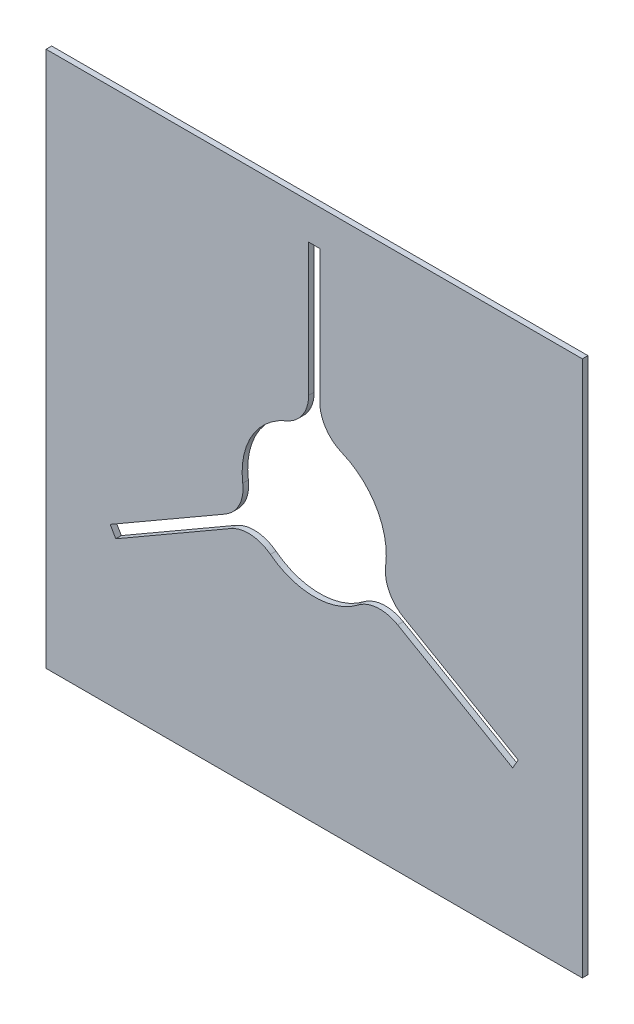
ISO-10303-21;
HEADER;
FILE_DESCRIPTION(('STEP AP214'),'2;1');
FILE_NAME('part.step','',(''),(''),'','','');
FILE_SCHEMA(('AUTOMOTIVE_DESIGN { 1 0 10303 214 1 1 1 1 }'));
ENDSEC;
DATA;
#1=APPLICATION_CONTEXT('core data for automotive mechanical design processes');
#2=APPLICATION_PROTOCOL_DEFINITION('international standard','automotive_design',2000,#1);
#3=PRODUCT_CONTEXT('',#1,'mechanical');
#4=PRODUCT('Part','Part','',(#3));
#5=PRODUCT_RELATED_PRODUCT_CATEGORY('part','',(#4));
#6=PRODUCT_DEFINITION_FORMATION('','',#4);
#7=PRODUCT_DEFINITION_CONTEXT('part definition',#1,'design');
#8=PRODUCT_DEFINITION('design','',#6,#7);
#9=PRODUCT_DEFINITION_SHAPE('','',#8);
#10=(LENGTH_UNIT() NAMED_UNIT(*) SI_UNIT(.MILLI.,.METRE.));
#11=(NAMED_UNIT(*) PLANE_ANGLE_UNIT() SI_UNIT($,.RADIAN.));
#12=(NAMED_UNIT(*) SI_UNIT($,.STERADIAN.) SOLID_ANGLE_UNIT());
#13=UNCERTAINTY_MEASURE_WITH_UNIT(LENGTH_MEASURE(1.E-05),#10,'distance_accuracy_value','');
#14=(GEOMETRIC_REPRESENTATION_CONTEXT(3) GLOBAL_UNCERTAINTY_ASSIGNED_CONTEXT((#13)) GLOBAL_UNIT_ASSIGNED_CONTEXT((#10,
#11,#12)) REPRESENTATION_CONTEXT('',''));
#15=CARTESIAN_POINT('',(0.,0.,0.));
#16=DIRECTION('',(0.,0.,1.));
#17=DIRECTION('',(1.,0.,0.));
#18=AXIS2_PLACEMENT_3D('',#15,#16,#17);
#19=CARTESIAN_POINT('',(0.,0.,0.));
#20=DIRECTION('',(0.,0.,1.));
#21=DIRECTION('',(1.,0.,0.));
#22=AXIS2_PLACEMENT_3D('',#19,#20,#21);
#23=CYLINDRICAL_SURFACE('',#22,20.4851);
#24=CARTESIAN_POINT('',(0.,0.,1.5875));
#25=DIRECTION('',(0.,0.,1.));
#26=DIRECTION('',(1.,0.,0.));
#27=AXIS2_PLACEMENT_3D('',#24,#25,#26);
#28=CIRCLE('',#27,20.4851);
#29=CARTESIAN_POINT('',(-7.85276315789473,18.9201858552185,1.5875));
#30=VERTEX_POINT('',#29);
#31=CARTESIAN_POINT('',(-20.3117431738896,-2.65940054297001,1.5875));
#32=VERTEX_POINT('',#31);
#33=EDGE_CURVE('E273',#30,#32,#28,.T.);
#34=ORIENTED_EDGE('',*,*,#33,.T.);
#35=DIRECTION('',(0.,0.,1.));
#36=VECTOR('',#35,1.);
#37=CARTESIAN_POINT('',(-20.3117431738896,-2.65940054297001,0.));
#38=LINE('',#37,#36);
#39=CARTESIAN_POINT('',(-20.3117431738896,-2.65940054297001,0.));
#40=VERTEX_POINT('',#39);
#41=EDGE_CURVE('E325',#32,#40,#38,.F.);
#42=ORIENTED_EDGE('',*,*,#41,.T.);
#43=CARTESIAN_POINT('',(0.,0.,0.));
#44=DIRECTION('',(0.,0.,1.));
#45=DIRECTION('',(1.,0.,0.));
#46=AXIS2_PLACEMENT_3D('',#43,#44,#45);
#47=CIRCLE('',#46,20.4851);
#48=CARTESIAN_POINT('',(-7.85276315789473,18.9201858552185,0.));
#49=VERTEX_POINT('',#48);
#50=EDGE_CURVE('E267',#49,#40,#47,.T.);
#51=ORIENTED_EDGE('',*,*,#50,.F.);
#52=DIRECTION('',(0.,0.,1.));
#53=VECTOR('',#52,1.);
#54=CARTESIAN_POINT('',(-7.85276315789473,18.9201858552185,0.));
#55=LINE('',#54,#53);
#56=EDGE_CURVE('E306',#49,#30,#55,.T.);
#57=ORIENTED_EDGE('',*,*,#56,.T.);
#58=EDGE_LOOP('',(#34,#42,#51,#57));
#59=FACE_BOUND('',#58,.T.);
#60=ADVANCED_FACE('F41',(#59),#23,.F.);
#61=CARTESIAN_POINT('',(-12.4589800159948,-16.2607853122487,1.5875));
#62=VERTEX_POINT('',#61);
#63=CARTESIAN_POINT('',(12.458980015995,-16.2607853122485,1.5875));
#64=VERTEX_POINT('',#63);
#65=EDGE_CURVE('E276',#62,#64,#28,.T.);
#66=ORIENTED_EDGE('',*,*,#65,.T.);
#67=DIRECTION('',(0.,0.,1.));
#68=VECTOR('',#67,1.);
#69=CARTESIAN_POINT('',(12.458980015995,-16.2607853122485,0.));
#70=LINE('',#69,#68);
#71=CARTESIAN_POINT('',(12.458980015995,-16.2607853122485,0.));
#72=VERTEX_POINT('',#71);
#73=EDGE_CURVE('E343',#64,#72,#70,.F.);
#74=ORIENTED_EDGE('',*,*,#73,.T.);
#75=CARTESIAN_POINT('',(-12.4589800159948,-16.2607853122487,0.));
#76=VERTEX_POINT('',#75);
#77=EDGE_CURVE('E271',#76,#72,#47,.T.);
#78=ORIENTED_EDGE('',*,*,#77,.F.);
#79=DIRECTION('',(0.,0.,1.));
#80=VECTOR('',#79,1.);
#81=CARTESIAN_POINT('',(-12.4589800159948,-16.2607853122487,0.));
#82=LINE('',#81,#80);
#83=EDGE_CURVE('E338',#76,#62,#82,.T.);
#84=ORIENTED_EDGE('',*,*,#83,.T.);
#85=EDGE_LOOP('',(#66,#74,#78,#84));
#86=FACE_BOUND('',#85,.T.);
#87=ADVANCED_FACE('F366',(#86),#23,.F.);
#88=CARTESIAN_POINT('',(76.2,76.2,1.5875));
#89=DIRECTION('',(-1.,0.,0.));
#90=DIRECTION('',(0.,-1.,0.));
#91=AXIS2_PLACEMENT_3D('',#88,#89,#90);
#92=PLANE('',#91);
#93=DIRECTION('',(0.,1.,0.));
#94=VECTOR('',#93,1.);
#95=CARTESIAN_POINT('',(76.2,76.2,0.));
#96=LINE('',#95,#94);
#97=CARTESIAN_POINT('',(76.2,-76.2,0.));
#98=VERTEX_POINT('',#97);
#99=CARTESIAN_POINT('',(76.2,76.2,0.));
#100=VERTEX_POINT('',#99);
#101=EDGE_CURVE('E270',#98,#100,#96,.T.);
#102=ORIENTED_EDGE('',*,*,#101,.T.);
#103=DIRECTION('',(0.,0.,-1.));
#104=VECTOR('',#103,1.);
#105=CARTESIAN_POINT('',(76.2,76.2,1.5875));
#106=LINE('',#105,#104);
#107=CARTESIAN_POINT('',(76.2,76.2,1.5875));
#108=VERTEX_POINT('',#107);
#109=EDGE_CURVE('E303',#108,#100,#106,.T.);
#110=ORIENTED_EDGE('',*,*,#109,.F.);
#111=DIRECTION('',(0.,1.,0.));
#112=VECTOR('',#111,1.);
#113=CARTESIAN_POINT('',(76.2,76.2,1.5875));
#114=LINE('',#113,#112);
#115=CARTESIAN_POINT('',(76.2,-76.2,1.5875));
#116=VERTEX_POINT('',#115);
#117=EDGE_CURVE('E277',#116,#108,#114,.T.);
#118=ORIENTED_EDGE('',*,*,#117,.F.);
#119=DIRECTION('',(0.,0.,-1.));
#120=VECTOR('',#119,1.);
#121=CARTESIAN_POINT('',(76.2,-76.2,1.5875));
#122=LINE('',#121,#120);
#123=EDGE_CURVE('E287',#116,#98,#122,.T.);
#124=ORIENTED_EDGE('',*,*,#123,.T.);
#125=EDGE_LOOP('',(#102,#110,#118,#124));
#126=FACE_BOUND('',#125,.T.);
#127=ADVANCED_FACE('F433',(#126),#92,.F.);
#128=CARTESIAN_POINT('',(-76.2,76.2,1.5875));
#129=DIRECTION('',(0.,-1.,0.));
#130=DIRECTION('',(0.,0.,-1.));
#131=AXIS2_PLACEMENT_3D('',#128,#129,#130);
#132=PLANE('',#131);
#133=DIRECTION('',(-1.,0.,0.));
#134=VECTOR('',#133,1.);
#135=CARTESIAN_POINT('',(-76.2,76.2,0.));
#136=LINE('',#135,#134);
#137=CARTESIAN_POINT('',(-76.2,76.2,0.));
#138=VERTEX_POINT('',#137);
#139=EDGE_CURVE('E290',#100,#138,#136,.T.);
#140=ORIENTED_EDGE('',*,*,#139,.T.);
#141=DIRECTION('',(0.,0.,-1.));
#142=VECTOR('',#141,1.);
#143=CARTESIAN_POINT('',(-76.2,76.2,1.5875));
#144=LINE('',#143,#142);
#145=CARTESIAN_POINT('',(-76.2,76.2,1.5875));
#146=VERTEX_POINT('',#145);
#147=EDGE_CURVE('E300',#146,#138,#144,.T.);
#148=ORIENTED_EDGE('',*,*,#147,.F.);
#149=DIRECTION('',(-1.,0.,0.));
#150=VECTOR('',#149,1.);
#151=CARTESIAN_POINT('',(-76.2,76.2,1.5875));
#152=LINE('',#151,#150);
#153=EDGE_CURVE('E280',#108,#146,#152,.T.);
#154=ORIENTED_EDGE('',*,*,#153,.F.);
#155=ORIENTED_EDGE('',*,*,#109,.T.);
#156=EDGE_LOOP('',(#140,#148,#154,#155));
#157=FACE_BOUND('',#156,.T.);
#158=ADVANCED_FACE('F454',(#157),#132,.F.);
#159=CARTESIAN_POINT('',(-76.2,76.2,1.5875));
#160=DIRECTION('',(1.,0.,0.));
#161=DIRECTION('',(0.,1.,0.));
#162=AXIS2_PLACEMENT_3D('',#159,#160,#161);
#163=PLANE('',#162);
#164=DIRECTION('',(0.,-1.,0.));
#165=VECTOR('',#164,1.);
#166=CARTESIAN_POINT('',(-76.2,76.2,0.));
#167=LINE('',#166,#165);
#168=CARTESIAN_POINT('',(-76.2,-76.2,0.));
#169=VERTEX_POINT('',#168);
#170=EDGE_CURVE('E292',#138,#169,#167,.T.);
#171=ORIENTED_EDGE('',*,*,#170,.T.);
#172=DIRECTION('',(0.,0.,-1.));
#173=VECTOR('',#172,1.);
#174=CARTESIAN_POINT('',(-76.2,-76.2,1.5875));
#175=LINE('',#174,#173);
#176=CARTESIAN_POINT('',(-76.2,-76.2,1.5875));
#177=VERTEX_POINT('',#176);
#178=EDGE_CURVE('E297',#177,#169,#175,.T.);
#179=ORIENTED_EDGE('',*,*,#178,.F.);
#180=DIRECTION('',(0.,-1.,0.));
#181=VECTOR('',#180,1.);
#182=CARTESIAN_POINT('',(-76.2,76.2,1.5875));
#183=LINE('',#182,#181);
#184=EDGE_CURVE('E283',#146,#177,#183,.T.);
#185=ORIENTED_EDGE('',*,*,#184,.F.);
#186=ORIENTED_EDGE('',*,*,#147,.T.);
#187=EDGE_LOOP('',(#171,#179,#185,#186));
#188=FACE_BOUND('',#187,.T.);
#189=ADVANCED_FACE('F450',(#188),#163,.F.);
#190=CARTESIAN_POINT('',(-76.2,-76.2,1.5875));
#191=DIRECTION('',(0.,1.,0.));
#192=DIRECTION('',(0.,0.,1.));
#193=AXIS2_PLACEMENT_3D('',#190,#191,#192);
#194=PLANE('',#193);
#195=DIRECTION('',(1.,0.,0.));
#196=VECTOR('',#195,1.);
#197=CARTESIAN_POINT('',(-76.2,-76.2,0.));
#198=LINE('',#197,#196);
#199=EDGE_CURVE('E281',#169,#98,#198,.T.);
#200=ORIENTED_EDGE('',*,*,#199,.T.);
#201=ORIENTED_EDGE('',*,*,#123,.F.);
#202=DIRECTION('',(1.,0.,0.));
#203=VECTOR('',#202,1.);
#204=CARTESIAN_POINT('',(-76.2,-76.2,1.5875));
#205=LINE('',#204,#203);
#206=EDGE_CURVE('E285',#177,#116,#205,.T.);
#207=ORIENTED_EDGE('',*,*,#206,.F.);
#208=ORIENTED_EDGE('',*,*,#178,.T.);
#209=EDGE_LOOP('',(#200,#201,#207,#208));
#210=FACE_BOUND('',#209,.T.);
#211=ADVANCED_FACE('F446',(#210),#194,.F.);
#212=CARTESIAN_POINT('',(0.,0.,1.5875));
#213=DIRECTION('',(0.,0.,1.));
#214=DIRECTION('',(1.,0.,0.));
#215=AXIS2_PLACEMENT_3D('',#212,#213,#214);
#216=PLANE('',#215);
#217=DIRECTION('',(0.866025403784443,-0.499999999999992,0.));
#218=VECTOR('',#217,1.);
#219=CARTESIAN_POINT('',(56.3985676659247,-34.3948153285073,1.5875));
#220=LINE('',#219,#218);
#221=CARTESIAN_POINT('',(23.7182633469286,-15.5268328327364,1.5875));
#222=VERTEX_POINT('',#221);
#223=CARTESIAN_POINT('',(56.3985676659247,-34.3948153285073,1.5875));
#224=VERTEX_POINT('',#223);
#225=EDGE_CURVE('E207',#222,#224,#220,.T.);
#226=ORIENTED_EDGE('',*,*,#225,.F.);
#227=CARTESIAN_POINT('',(18.6382633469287,-24.3256509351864,1.5875));
#228=DIRECTION('',(0.,0.,1.));
#229=DIRECTION('',(1.,0.,0.));
#230=AXIS2_PLACEMENT_3D('',#227,#228,#229);
#231=CIRCLE('',#230,10.16);
#232=EDGE_CURVE('E352',#222,#64,#231,.T.);
#233=ORIENTED_EDGE('',*,*,#232,.T.);
#234=ORIENTED_EDGE('',*,*,#65,.F.);
#235=CARTESIAN_POINT('',(-18.6382633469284,-24.3256509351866,1.5875));
#236=DIRECTION('',(0.,0.,1.));
#237=DIRECTION('',(1.,0.,0.));
#238=AXIS2_PLACEMENT_3D('',#235,#236,#237);
#239=CIRCLE('',#238,10.16);
#240=CARTESIAN_POINT('',(-23.7182633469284,-15.5268328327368,1.5875));
#241=VERTEX_POINT('',#240);
#242=EDGE_CURVE('E334',#62,#241,#239,.T.);
#243=ORIENTED_EDGE('',*,*,#242,.T.);
#244=DIRECTION('',(0.866025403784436,0.500000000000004,0.));
#245=VECTOR('',#244,1.);
#246=CARTESIAN_POINT('',(-56.3985676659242,-34.3948153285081,1.5875));
#247=LINE('',#246,#245);
#248=CARTESIAN_POINT('',(-56.3985676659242,-34.3948153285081,1.5875));
#249=VERTEX_POINT('',#248);
#250=EDGE_CURVE('E228',#249,#241,#247,.T.);
#251=ORIENTED_EDGE('',*,*,#250,.F.);
#252=DIRECTION('',(0.500000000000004,-0.866025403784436,0.));
#253=VECTOR('',#252,1.);
#254=CARTESIAN_POINT('',(-56.3985676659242,-34.3948153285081,1.5875));
#255=LINE('',#254,#253);
#256=CARTESIAN_POINT('',(-57.9860676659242,-31.6451846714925,1.5875));
#257=VERTEX_POINT('',#256);
#258=EDGE_CURVE('E236',#257,#249,#255,.T.);
#259=ORIENTED_EDGE('',*,*,#258,.F.);
#260=DIRECTION('',(-0.866025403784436,-0.500000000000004,0.));
#261=VECTOR('',#260,1.);
#262=CARTESIAN_POINT('',(-57.9860676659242,-31.6451846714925,1.5875));
#263=LINE('',#262,#261);
#264=CARTESIAN_POINT('',(-25.3057633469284,-12.7772021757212,1.5875));
#265=VERTEX_POINT('',#264);
#266=EDGE_CURVE('E223',#265,#257,#263,.T.);
#267=ORIENTED_EDGE('',*,*,#266,.F.);
#268=CARTESIAN_POINT('',(-30.3857633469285,-3.97838407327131,1.5875));
#269=DIRECTION('',(0.,0.,1.));
#270=DIRECTION('',(1.,0.,0.));
#271=AXIS2_PLACEMENT_3D('',#268,#269,#270);
#272=CIRCLE('',#271,10.16);
#273=EDGE_CURVE('E336',#265,#32,#272,.T.);
#274=ORIENTED_EDGE('',*,*,#273,.T.);
#275=ORIENTED_EDGE('',*,*,#33,.F.);
#276=CARTESIAN_POINT('',(-11.7475,28.3040350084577,1.5875));
#277=DIRECTION('',(0.,0.,1.));
#278=DIRECTION('',(1.,0.,0.));
#279=AXIS2_PLACEMENT_3D('',#276,#277,#278);
#280=CIRCLE('',#279,10.16);
#281=CARTESIAN_POINT('',(-1.5875,28.3040350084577,1.5875));
#282=VERTEX_POINT('',#281);
#283=EDGE_CURVE('E318',#30,#282,#280,.T.);
#284=ORIENTED_EDGE('',*,*,#283,.T.);
#285=DIRECTION('',(0.,-1.,0.));
#286=VECTOR('',#285,1.);
#287=CARTESIAN_POINT('',(-1.5875,66.04,1.5875));
#288=LINE('',#287,#286);
#289=CARTESIAN_POINT('',(-1.5875,66.04,1.5875));
#290=VERTEX_POINT('',#289);
#291=EDGE_CURVE('E249',#290,#282,#288,.T.);
#292=ORIENTED_EDGE('',*,*,#291,.F.);
#293=DIRECTION('',(-1.,0.,0.));
#294=VECTOR('',#293,1.);
#295=CARTESIAN_POINT('',(-1.5875,66.04,1.5875));
#296=LINE('',#295,#294);
#297=CARTESIAN_POINT('',(1.5875,66.04,1.5875));
#298=VERTEX_POINT('',#297);
#299=EDGE_CURVE('E257',#298,#290,#296,.T.);
#300=ORIENTED_EDGE('',*,*,#299,.F.);
#301=DIRECTION('',(0.,1.,0.));
#302=VECTOR('',#301,1.);
#303=CARTESIAN_POINT('',(1.5875,66.04,1.5875));
#304=LINE('',#303,#302);
#305=CARTESIAN_POINT('',(1.5875,28.3040350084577,1.5875));
#306=VERTEX_POINT('',#305);
#307=EDGE_CURVE('E243',#306,#298,#304,.T.);
#308=ORIENTED_EDGE('',*,*,#307,.F.);
#309=CARTESIAN_POINT('',(11.7475,28.3040350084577,1.5875));
#310=DIRECTION('',(0.,0.,1.));
#311=DIRECTION('',(1.,0.,0.));
#312=AXIS2_PLACEMENT_3D('',#309,#310,#311);
#313=CIRCLE('',#312,10.16);
#314=CARTESIAN_POINT('',(7.85276315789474,18.9201858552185,1.5875));
#315=VERTEX_POINT('',#314);
#316=EDGE_CURVE('E320',#306,#315,#313,.T.);
#317=ORIENTED_EDGE('',*,*,#316,.T.);
#318=CARTESIAN_POINT('',(20.3117431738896,-2.65940054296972,1.5875));
#319=VERTEX_POINT('',#318);
#320=EDGE_CURVE('E264',#319,#315,#28,.T.);
#321=ORIENTED_EDGE('',*,*,#320,.F.);
#322=CARTESIAN_POINT('',(30.3857633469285,-3.97838407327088,1.5875));
#323=DIRECTION('',(0.,0.,1.));
#324=DIRECTION('',(1.,0.,0.));
#325=AXIS2_PLACEMENT_3D('',#322,#323,#324);
#326=CIRCLE('',#325,10.16);
#327=CARTESIAN_POINT('',(25.3057633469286,-12.7772021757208,1.5875));
#328=VERTEX_POINT('',#327);
#329=EDGE_CURVE('E56',#319,#328,#326,.T.);
#330=ORIENTED_EDGE('',*,*,#329,.T.);
#331=DIRECTION('',(-0.866025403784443,0.499999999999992,0.));
#332=VECTOR('',#331,1.);
#333=CARTESIAN_POINT('',(57.9860676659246,-31.6451846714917,1.5875));
#334=LINE('',#333,#332);
#335=CARTESIAN_POINT('',(57.9860676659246,-31.6451846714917,1.5875));
#336=VERTEX_POINT('',#335);
#337=EDGE_CURVE('E201',#336,#328,#334,.T.);
#338=ORIENTED_EDGE('',*,*,#337,.F.);
#339=DIRECTION('',(0.499999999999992,0.866025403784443,0.));
#340=VECTOR('',#339,1.);
#341=CARTESIAN_POINT('',(57.9860676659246,-31.6451846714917,1.5875));
#342=LINE('',#341,#340);
#343=EDGE_CURVE('E220',#224,#336,#342,.T.);
#344=ORIENTED_EDGE('',*,*,#343,.F.);
#345=EDGE_LOOP('',(#226,#233,#234,#243,#251,#259,#267,#274,#275,#284,#292,#300,#308,#317,#321,
#330,#338,#344));
#346=FACE_BOUND('',#345,.T.);
#347=ORIENTED_EDGE('',*,*,#117,.T.);
#348=ORIENTED_EDGE('',*,*,#153,.T.);
#349=ORIENTED_EDGE('',*,*,#184,.T.);
#350=ORIENTED_EDGE('',*,*,#206,.T.);
#351=EDGE_LOOP('',(#347,#348,#349,#350));
#352=FACE_BOUND('',#351,.T.);
#353=ADVANCED_FACE('F357',(#346,#352),#216,.T.);
#354=CARTESIAN_POINT('',(0.,0.,0.));
#355=DIRECTION('',(0.,0.,1.));
#356=DIRECTION('',(1.,0.,0.));
#357=AXIS2_PLACEMENT_3D('',#354,#355,#356);
#358=PLANE('',#357);
#359=ORIENTED_EDGE('',*,*,#77,.T.);
#360=CARTESIAN_POINT('',(18.6382633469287,-24.3256509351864,0.));
#361=DIRECTION('',(0.,0.,1.));
#362=DIRECTION('',(1.,0.,0.));
#363=AXIS2_PLACEMENT_3D('',#360,#361,#362);
#364=CIRCLE('',#363,10.16);
#365=CARTESIAN_POINT('',(23.7182633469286,-15.5268328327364,0.));
#366=VERTEX_POINT('',#365);
#367=EDGE_CURVE('E198',#72,#366,#364,.F.);
#368=ORIENTED_EDGE('',*,*,#367,.T.);
#369=DIRECTION('',(0.866025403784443,-0.499999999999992,0.));
#370=VECTOR('',#369,1.);
#371=CARTESIAN_POINT('',(56.3985676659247,-34.3948153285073,0.));
#372=LINE('',#371,#370);
#373=CARTESIAN_POINT('',(56.3985676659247,-34.3948153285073,0.));
#374=VERTEX_POINT('',#373);
#375=EDGE_CURVE('E190',#366,#374,#372,.T.);
#376=ORIENTED_EDGE('',*,*,#375,.T.);
#377=DIRECTION('',(0.499999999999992,0.866025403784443,0.));
#378=VECTOR('',#377,1.);
#379=CARTESIAN_POINT('',(57.9860676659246,-31.6451846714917,0.));
#380=LINE('',#379,#378);
#381=CARTESIAN_POINT('',(57.9860676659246,-31.6451846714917,0.));
#382=VERTEX_POINT('',#381);
#383=EDGE_CURVE('E197',#374,#382,#380,.T.);
#384=ORIENTED_EDGE('',*,*,#383,.T.);
#385=DIRECTION('',(-0.866025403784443,0.499999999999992,0.));
#386=VECTOR('',#385,1.);
#387=CARTESIAN_POINT('',(57.9860676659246,-31.6451846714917,0.));
#388=LINE('',#387,#386);
#389=CARTESIAN_POINT('',(25.3057633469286,-12.7772021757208,0.));
#390=VERTEX_POINT('',#389);
#391=EDGE_CURVE('E212',#382,#390,#388,.T.);
#392=ORIENTED_EDGE('',*,*,#391,.T.);
#393=CARTESIAN_POINT('',(30.3857633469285,-3.97838407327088,0.));
#394=DIRECTION('',(0.,0.,1.));
#395=DIRECTION('',(1.,0.,0.));
#396=AXIS2_PLACEMENT_3D('',#393,#394,#395);
#397=CIRCLE('',#396,10.16);
#398=CARTESIAN_POINT('',(20.3117431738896,-2.65940054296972,0.));
#399=VERTEX_POINT('',#398);
#400=EDGE_CURVE('E346',#390,#399,#397,.F.);
#401=ORIENTED_EDGE('',*,*,#400,.T.);
#402=CARTESIAN_POINT('',(7.85276315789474,18.9201858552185,0.));
#403=VERTEX_POINT('',#402);
#404=EDGE_CURVE('E272',#399,#403,#47,.T.);
#405=ORIENTED_EDGE('',*,*,#404,.T.);
#406=CARTESIAN_POINT('',(11.7475,28.3040350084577,0.));
#407=DIRECTION('',(0.,0.,1.));
#408=DIRECTION('',(1.,0.,0.));
#409=AXIS2_PLACEMENT_3D('',#406,#407,#408);
#410=CIRCLE('',#409,10.16);
#411=CARTESIAN_POINT('',(1.5875,28.3040350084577,0.));
#412=VERTEX_POINT('',#411);
#413=EDGE_CURVE('E314',#403,#412,#410,.F.);
#414=ORIENTED_EDGE('',*,*,#413,.T.);
#415=DIRECTION('',(0.,1.,0.));
#416=VECTOR('',#415,1.);
#417=CARTESIAN_POINT('',(1.5875,66.04,0.));
#418=LINE('',#417,#416);
#419=CARTESIAN_POINT('',(1.5875,66.04,0.));
#420=VERTEX_POINT('',#419);
#421=EDGE_CURVE('E246',#412,#420,#418,.T.);
#422=ORIENTED_EDGE('',*,*,#421,.T.);
#423=DIRECTION('',(-1.,0.,0.));
#424=VECTOR('',#423,1.);
#425=CARTESIAN_POINT('',(-1.5875,66.04,0.));
#426=LINE('',#425,#424);
#427=CARTESIAN_POINT('',(-1.5875,66.04,0.));
#428=VERTEX_POINT('',#427);
#429=EDGE_CURVE('E248',#420,#428,#426,.T.);
#430=ORIENTED_EDGE('',*,*,#429,.T.);
#431=DIRECTION('',(0.,-1.,0.));
#432=VECTOR('',#431,1.);
#433=CARTESIAN_POINT('',(-1.5875,66.04,0.));
#434=LINE('',#433,#432);
#435=CARTESIAN_POINT('',(-1.5875,28.3040350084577,0.));
#436=VERTEX_POINT('',#435);
#437=EDGE_CURVE('E252',#428,#436,#434,.T.);
#438=ORIENTED_EDGE('',*,*,#437,.T.);
#439=CARTESIAN_POINT('',(-11.7475,28.3040350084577,0.));
#440=DIRECTION('',(0.,0.,1.));
#441=DIRECTION('',(1.,0.,0.));
#442=AXIS2_PLACEMENT_3D('',#439,#440,#441);
#443=CIRCLE('',#442,10.16);
#444=EDGE_CURVE('E312',#436,#49,#443,.F.);
#445=ORIENTED_EDGE('',*,*,#444,.T.);
#446=ORIENTED_EDGE('',*,*,#50,.T.);
#447=CARTESIAN_POINT('',(-30.3857633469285,-3.97838407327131,0.));
#448=DIRECTION('',(0.,0.,1.));
#449=DIRECTION('',(1.,0.,0.));
#450=AXIS2_PLACEMENT_3D('',#447,#448,#449);
#451=CIRCLE('',#450,10.16);
#452=CARTESIAN_POINT('',(-25.3057633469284,-12.7772021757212,0.));
#453=VERTEX_POINT('',#452);
#454=EDGE_CURVE('E330',#40,#453,#451,.F.);
#455=ORIENTED_EDGE('',*,*,#454,.T.);
#456=DIRECTION('',(-0.866025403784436,-0.500000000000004,0.));
#457=VECTOR('',#456,1.);
#458=CARTESIAN_POINT('',(-57.9860676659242,-31.6451846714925,0.));
#459=LINE('',#458,#457);
#460=CARTESIAN_POINT('',(-57.9860676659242,-31.6451846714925,0.));
#461=VERTEX_POINT('',#460);
#462=EDGE_CURVE('E225',#453,#461,#459,.T.);
#463=ORIENTED_EDGE('',*,*,#462,.T.);
#464=DIRECTION('',(0.500000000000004,-0.866025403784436,0.));
#465=VECTOR('',#464,1.);
#466=CARTESIAN_POINT('',(-56.3985676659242,-34.3948153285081,0.));
#467=LINE('',#466,#465);
#468=CARTESIAN_POINT('',(-56.3985676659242,-34.3948153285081,0.));
#469=VERTEX_POINT('',#468);
#470=EDGE_CURVE('E227',#461,#469,#467,.T.);
#471=ORIENTED_EDGE('',*,*,#470,.T.);
#472=DIRECTION('',(0.866025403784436,0.500000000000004,0.));
#473=VECTOR('',#472,1.);
#474=CARTESIAN_POINT('',(-56.3985676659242,-34.3948153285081,0.));
#475=LINE('',#474,#473);
#476=CARTESIAN_POINT('',(-23.7182633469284,-15.5268328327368,0.));
#477=VERTEX_POINT('',#476);
#478=EDGE_CURVE('E231',#469,#477,#475,.T.);
#479=ORIENTED_EDGE('',*,*,#478,.T.);
#480=CARTESIAN_POINT('',(-18.6382633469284,-24.3256509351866,0.));
#481=DIRECTION('',(0.,0.,1.));
#482=DIRECTION('',(1.,0.,0.));
#483=AXIS2_PLACEMENT_3D('',#480,#481,#482);
#484=CIRCLE('',#483,10.16);
#485=EDGE_CURVE('E328',#477,#76,#484,.F.);
#486=ORIENTED_EDGE('',*,*,#485,.T.);
#487=EDGE_LOOP('',(#359,#368,#376,#384,#392,#401,#405,#414,#422,#430,#438,#445,#446,#455,#463,
#471,#479,#486));
#488=FACE_BOUND('',#487,.T.);
#489=ORIENTED_EDGE('',*,*,#101,.F.);
#490=ORIENTED_EDGE('',*,*,#199,.F.);
#491=ORIENTED_EDGE('',*,*,#170,.F.);
#492=ORIENTED_EDGE('',*,*,#139,.F.);
#493=EDGE_LOOP('',(#489,#490,#491,#492));
#494=FACE_BOUND('',#493,.T.);
#495=ADVANCED_FACE('F193',(#488,#494),#358,.F.);
#496=ORIENTED_EDGE('',*,*,#404,.F.);
#497=DIRECTION('',(0.,0.,1.));
#498=VECTOR('',#497,1.);
#499=CARTESIAN_POINT('',(20.3117431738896,-2.65940054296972,0.));
#500=LINE('',#499,#498);
#501=EDGE_CURVE('E49',#399,#319,#500,.T.);
#502=ORIENTED_EDGE('',*,*,#501,.T.);
#503=ORIENTED_EDGE('',*,*,#320,.T.);
#504=DIRECTION('',(0.,0.,1.));
#505=VECTOR('',#504,1.);
#506=CARTESIAN_POINT('',(7.85276315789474,18.9201858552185,0.));
#507=LINE('',#506,#505);
#508=EDGE_CURVE('E309',#315,#403,#507,.F.);
#509=ORIENTED_EDGE('',*,*,#508,.T.);
#510=EDGE_LOOP('',(#496,#502,#503,#509));
#511=FACE_BOUND('',#510,.T.);
#512=ADVANCED_FACE('F355',(#511),#23,.F.);
#513=CARTESIAN_POINT('',(1.5875,66.04,0.));
#514=DIRECTION('',(1.,0.,0.));
#515=DIRECTION('',(0.,1.,0.));
#516=AXIS2_PLACEMENT_3D('',#513,#514,#515);
#517=PLANE('',#516);
#518=ORIENTED_EDGE('',*,*,#421,.F.);
#519=DIRECTION('',(0.,0.,1.));
#520=VECTOR('',#519,1.);
#521=CARTESIAN_POINT('',(1.5875,28.3040350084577,0.));
#522=LINE('',#521,#520);
#523=EDGE_CURVE('E316',#412,#306,#522,.T.);
#524=ORIENTED_EDGE('',*,*,#523,.T.);
#525=ORIENTED_EDGE('',*,*,#307,.T.);
#526=DIRECTION('',(0.,0.,1.));
#527=VECTOR('',#526,1.);
#528=CARTESIAN_POINT('',(1.5875,66.04,0.));
#529=LINE('',#528,#527);
#530=EDGE_CURVE('E255',#420,#298,#529,.T.);
#531=ORIENTED_EDGE('',*,*,#530,.F.);
#532=EDGE_LOOP('',(#518,#524,#525,#531));
#533=FACE_BOUND('',#532,.T.);
#534=ADVANCED_FACE('F380',(#533),#517,.F.);
#535=CARTESIAN_POINT('',(-1.5875,66.04,0.));
#536=DIRECTION('',(-1.,0.,0.));
#537=DIRECTION('',(0.,-1.,0.));
#538=AXIS2_PLACEMENT_3D('',#535,#536,#537);
#539=PLANE('',#538);
#540=ORIENTED_EDGE('',*,*,#291,.T.);
#541=DIRECTION('',(0.,0.,1.));
#542=VECTOR('',#541,1.);
#543=CARTESIAN_POINT('',(-1.5875,28.3040350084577,0.));
#544=LINE('',#543,#542);
#545=EDGE_CURVE('E323',#282,#436,#544,.F.);
#546=ORIENTED_EDGE('',*,*,#545,.T.);
#547=ORIENTED_EDGE('',*,*,#437,.F.);
#548=DIRECTION('',(0.,0.,1.));
#549=VECTOR('',#548,1.);
#550=CARTESIAN_POINT('',(-1.5875,66.04,0.));
#551=LINE('',#550,#549);
#552=EDGE_CURVE('E262',#428,#290,#551,.T.);
#553=ORIENTED_EDGE('',*,*,#552,.T.);
#554=EDGE_LOOP('',(#540,#546,#547,#553));
#555=FACE_BOUND('',#554,.T.);
#556=ADVANCED_FACE('F441',(#555),#539,.F.);
#557=CARTESIAN_POINT('',(-1.5875,66.04,0.));
#558=DIRECTION('',(0.,1.,0.));
#559=DIRECTION('',(0.,0.,1.));
#560=AXIS2_PLACEMENT_3D('',#557,#558,#559);
#561=PLANE('',#560);
#562=ORIENTED_EDGE('',*,*,#299,.T.);
#563=ORIENTED_EDGE('',*,*,#552,.F.);
#564=ORIENTED_EDGE('',*,*,#429,.F.);
#565=ORIENTED_EDGE('',*,*,#530,.T.);
#566=EDGE_LOOP('',(#562,#563,#564,#565));
#567=FACE_BOUND('',#566,.T.);
#568=ADVANCED_FACE('F385',(#567),#561,.F.);
#569=CARTESIAN_POINT('',(11.7475,28.3040350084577,0.));
#570=DIRECTION('',(0.,0.,1.));
#571=DIRECTION('',(1.,0.,0.));
#572=AXIS2_PLACEMENT_3D('',#569,#570,#571);
#573=CYLINDRICAL_SURFACE('',#572,10.16);
#574=ORIENTED_EDGE('',*,*,#316,.F.);
#575=ORIENTED_EDGE('',*,*,#523,.F.);
#576=ORIENTED_EDGE('',*,*,#413,.F.);
#577=ORIENTED_EDGE('',*,*,#508,.F.);
#578=EDGE_LOOP('',(#574,#575,#576,#577));
#579=FACE_BOUND('',#578,.T.);
#580=ADVANCED_FACE('F378',(#579),#573,.T.);
#581=CARTESIAN_POINT('',(-11.7475,28.3040350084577,0.));
#582=DIRECTION('',(0.,0.,1.));
#583=DIRECTION('',(1.,0.,0.));
#584=AXIS2_PLACEMENT_3D('',#581,#582,#583);
#585=CYLINDRICAL_SURFACE('',#584,10.16);
#586=ORIENTED_EDGE('',*,*,#444,.F.);
#587=ORIENTED_EDGE('',*,*,#545,.F.);
#588=ORIENTED_EDGE('',*,*,#283,.F.);
#589=ORIENTED_EDGE('',*,*,#56,.F.);
#590=EDGE_LOOP('',(#586,#587,#588,#589));
#591=FACE_BOUND('',#590,.T.);
#592=ADVANCED_FACE('F394',(#591),#585,.T.);
#593=CARTESIAN_POINT('',(57.9860676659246,-31.6451846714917,0.));
#594=DIRECTION('',(0.499999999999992,0.866025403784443,0.));
#595=DIRECTION('',(-0.866025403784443,0.499999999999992,0.));
#596=AXIS2_PLACEMENT_3D('',#593,#594,#595);
#597=PLANE('',#596);
#598=ORIENTED_EDGE('',*,*,#337,.T.);
#599=DIRECTION('',(0.,0.,1.));
#600=VECTOR('',#599,1.);
#601=CARTESIAN_POINT('',(25.3057633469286,-12.7772021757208,0.));
#602=LINE('',#601,#600);
#603=EDGE_CURVE('E11',#328,#390,#602,.F.);
#604=ORIENTED_EDGE('',*,*,#603,.T.);
#605=ORIENTED_EDGE('',*,*,#391,.F.);
#606=DIRECTION('',(0.,0.,1.));
#607=VECTOR('',#606,1.);
#608=CARTESIAN_POINT('',(57.9860676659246,-31.6451846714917,0.));
#609=LINE('',#608,#607);
#610=EDGE_CURVE('E211',#382,#336,#609,.T.);
#611=ORIENTED_EDGE('',*,*,#610,.T.);
#612=EDGE_LOOP('',(#598,#604,#605,#611));
#613=FACE_BOUND('',#612,.T.);
#614=ADVANCED_FACE('F373',(#613),#597,.F.);
#615=CARTESIAN_POINT('',(56.3985676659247,-34.3948153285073,0.));
#616=DIRECTION('',(-0.499999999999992,-0.866025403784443,0.));
#617=DIRECTION('',(0.866025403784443,-0.499999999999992,0.));
#618=AXIS2_PLACEMENT_3D('',#615,#616,#617);
#619=PLANE('',#618);
#620=ORIENTED_EDGE('',*,*,#375,.F.);
#621=DIRECTION('',(0.,0.,1.));
#622=VECTOR('',#621,1.);
#623=CARTESIAN_POINT('',(23.7182633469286,-15.5268328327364,0.));
#624=LINE('',#623,#622);
#625=EDGE_CURVE('E349',#366,#222,#624,.T.);
#626=ORIENTED_EDGE('',*,*,#625,.T.);
#627=ORIENTED_EDGE('',*,*,#225,.T.);
#628=DIRECTION('',(0.,0.,1.));
#629=VECTOR('',#628,1.);
#630=CARTESIAN_POINT('',(56.3985676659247,-34.3948153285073,0.));
#631=LINE('',#630,#629);
#632=EDGE_CURVE('E204',#374,#224,#631,.T.);
#633=ORIENTED_EDGE('',*,*,#632,.F.);
#634=EDGE_LOOP('',(#620,#626,#627,#633));
#635=FACE_BOUND('',#634,.T.);
#636=ADVANCED_FACE('F205',(#635),#619,.F.);
#637=CARTESIAN_POINT('',(57.9860676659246,-31.6451846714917,0.));
#638=DIRECTION('',(0.866025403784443,-0.499999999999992,0.));
#639=DIRECTION('',(0.499999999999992,0.866025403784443,0.));
#640=AXIS2_PLACEMENT_3D('',#637,#638,#639);
#641=PLANE('',#640);
#642=ORIENTED_EDGE('',*,*,#343,.T.);
#643=ORIENTED_EDGE('',*,*,#610,.F.);
#644=ORIENTED_EDGE('',*,*,#383,.F.);
#645=ORIENTED_EDGE('',*,*,#632,.T.);
#646=EDGE_LOOP('',(#642,#643,#644,#645));
#647=FACE_BOUND('',#646,.T.);
#648=ADVANCED_FACE('F214',(#647),#641,.F.);
#649=CARTESIAN_POINT('',(-57.9860676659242,-31.6451846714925,0.));
#650=DIRECTION('',(-0.500000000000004,0.866025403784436,0.));
#651=DIRECTION('',(-0.866025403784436,-0.500000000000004,0.));
#652=AXIS2_PLACEMENT_3D('',#649,#650,#651);
#653=PLANE('',#652);
#654=ORIENTED_EDGE('',*,*,#462,.F.);
#655=DIRECTION('',(0.,0.,1.));
#656=VECTOR('',#655,1.);
#657=CARTESIAN_POINT('',(-25.3057633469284,-12.7772021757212,0.));
#658=LINE('',#657,#656);
#659=EDGE_CURVE('E332',#453,#265,#658,.T.);
#660=ORIENTED_EDGE('',*,*,#659,.T.);
#661=ORIENTED_EDGE('',*,*,#266,.T.);
#662=DIRECTION('',(0.,0.,1.));
#663=VECTOR('',#662,1.);
#664=CARTESIAN_POINT('',(-57.9860676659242,-31.6451846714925,0.));
#665=LINE('',#664,#663);
#666=EDGE_CURVE('E234',#461,#257,#665,.T.);
#667=ORIENTED_EDGE('',*,*,#666,.F.);
#668=EDGE_LOOP('',(#654,#660,#661,#667));
#669=FACE_BOUND('',#668,.T.);
#670=ADVANCED_FACE('F407',(#669),#653,.F.);
#671=CARTESIAN_POINT('',(-56.3985676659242,-34.3948153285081,0.));
#672=DIRECTION('',(0.500000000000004,-0.866025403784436,0.));
#673=DIRECTION('',(0.866025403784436,0.500000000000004,0.));
#674=AXIS2_PLACEMENT_3D('',#671,#672,#673);
#675=PLANE('',#674);
#676=ORIENTED_EDGE('',*,*,#250,.T.);
#677=DIRECTION('',(0.,0.,1.));
#678=VECTOR('',#677,1.);
#679=CARTESIAN_POINT('',(-23.7182633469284,-15.5268328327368,0.));
#680=LINE('',#679,#678);
#681=EDGE_CURVE('E341',#241,#477,#680,.F.);
#682=ORIENTED_EDGE('',*,*,#681,.T.);
#683=ORIENTED_EDGE('',*,*,#478,.F.);
#684=DIRECTION('',(0.,0.,1.));
#685=VECTOR('',#684,1.);
#686=CARTESIAN_POINT('',(-56.3985676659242,-34.3948153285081,0.));
#687=LINE('',#686,#685);
#688=EDGE_CURVE('E241',#469,#249,#687,.T.);
#689=ORIENTED_EDGE('',*,*,#688,.T.);
#690=EDGE_LOOP('',(#676,#682,#683,#689));
#691=FACE_BOUND('',#690,.T.);
#692=ADVANCED_FACE('F418',(#691),#675,.F.);
#693=CARTESIAN_POINT('',(-56.3985676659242,-34.3948153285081,0.));
#694=DIRECTION('',(-0.866025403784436,-0.500000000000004,0.));
#695=DIRECTION('',(0.500000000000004,-0.866025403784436,0.));
#696=AXIS2_PLACEMENT_3D('',#693,#694,#695);
#697=PLANE('',#696);
#698=ORIENTED_EDGE('',*,*,#258,.T.);
#699=ORIENTED_EDGE('',*,*,#688,.F.);
#700=ORIENTED_EDGE('',*,*,#470,.F.);
#701=ORIENTED_EDGE('',*,*,#666,.T.);
#702=EDGE_LOOP('',(#698,#699,#700,#701));
#703=FACE_BOUND('',#702,.T.);
#704=ADVANCED_FACE('F410',(#703),#697,.F.);
#705=CARTESIAN_POINT('',(-30.3857633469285,-3.97838407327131,0.));
#706=DIRECTION('',(0.,0.,1.));
#707=DIRECTION('',(1.,0.,0.));
#708=AXIS2_PLACEMENT_3D('',#705,#706,#707);
#709=CYLINDRICAL_SURFACE('',#708,10.16);
#710=ORIENTED_EDGE('',*,*,#273,.F.);
#711=ORIENTED_EDGE('',*,*,#659,.F.);
#712=ORIENTED_EDGE('',*,*,#454,.F.);
#713=ORIENTED_EDGE('',*,*,#41,.F.);
#714=EDGE_LOOP('',(#710,#711,#712,#713));
#715=FACE_BOUND('',#714,.T.);
#716=ADVANCED_FACE('F403',(#715),#709,.T.);
#717=CARTESIAN_POINT('',(-18.6382633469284,-24.3256509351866,0.));
#718=DIRECTION('',(0.,0.,1.));
#719=DIRECTION('',(1.,0.,0.));
#720=AXIS2_PLACEMENT_3D('',#717,#718,#719);
#721=CYLINDRICAL_SURFACE('',#720,10.16);
#722=ORIENTED_EDGE('',*,*,#485,.F.);
#723=ORIENTED_EDGE('',*,*,#681,.F.);
#724=ORIENTED_EDGE('',*,*,#242,.F.);
#725=ORIENTED_EDGE('',*,*,#83,.F.);
#726=EDGE_LOOP('',(#722,#723,#724,#725));
#727=FACE_BOUND('',#726,.T.);
#728=ADVANCED_FACE('F416',(#727),#721,.T.);
#729=CARTESIAN_POINT('',(18.6382633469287,-24.3256509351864,0.));
#730=DIRECTION('',(0.,0.,1.));
#731=DIRECTION('',(1.,0.,0.));
#732=AXIS2_PLACEMENT_3D('',#729,#730,#731);
#733=CYLINDRICAL_SURFACE('',#732,10.16);
#734=ORIENTED_EDGE('',*,*,#232,.F.);
#735=ORIENTED_EDGE('',*,*,#625,.F.);
#736=ORIENTED_EDGE('',*,*,#367,.F.);
#737=ORIENTED_EDGE('',*,*,#73,.F.);
#738=EDGE_LOOP('',(#734,#735,#736,#737));
#739=FACE_BOUND('',#738,.T.);
#740=ADVANCED_FACE('F371',(#739),#733,.T.);
#741=CARTESIAN_POINT('',(30.3857633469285,-3.97838407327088,0.));
#742=DIRECTION('',(0.,0.,1.));
#743=DIRECTION('',(1.,0.,0.));
#744=AXIS2_PLACEMENT_3D('',#741,#742,#743);
#745=CYLINDRICAL_SURFACE('',#744,10.16);
#746=ORIENTED_EDGE('',*,*,#400,.F.);
#747=ORIENTED_EDGE('',*,*,#603,.F.);
#748=ORIENTED_EDGE('',*,*,#329,.F.);
#749=ORIENTED_EDGE('',*,*,#501,.F.);
#750=EDGE_LOOP('',(#746,#747,#748,#749));
#751=FACE_BOUND('',#750,.T.);
#752=ADVANCED_FACE('F43',(#751),#745,.T.);
#753=CLOSED_SHELL('',(#60,#87,#127,#158,#189,#211,#353,#495,#512,#534,#556,#568,#580,#592,#614,
#636,#648,#670,#692,#704,#716,#728,#740,#752));
#754=MANIFOLD_SOLID_BREP('B2',#753);
#755=ADVANCED_BREP_SHAPE_REPRESENTATION('',(#18,#754),#14);
#756=SHAPE_DEFINITION_REPRESENTATION(#9,#755);
ENDSEC;
END-ISO-10303-21;
